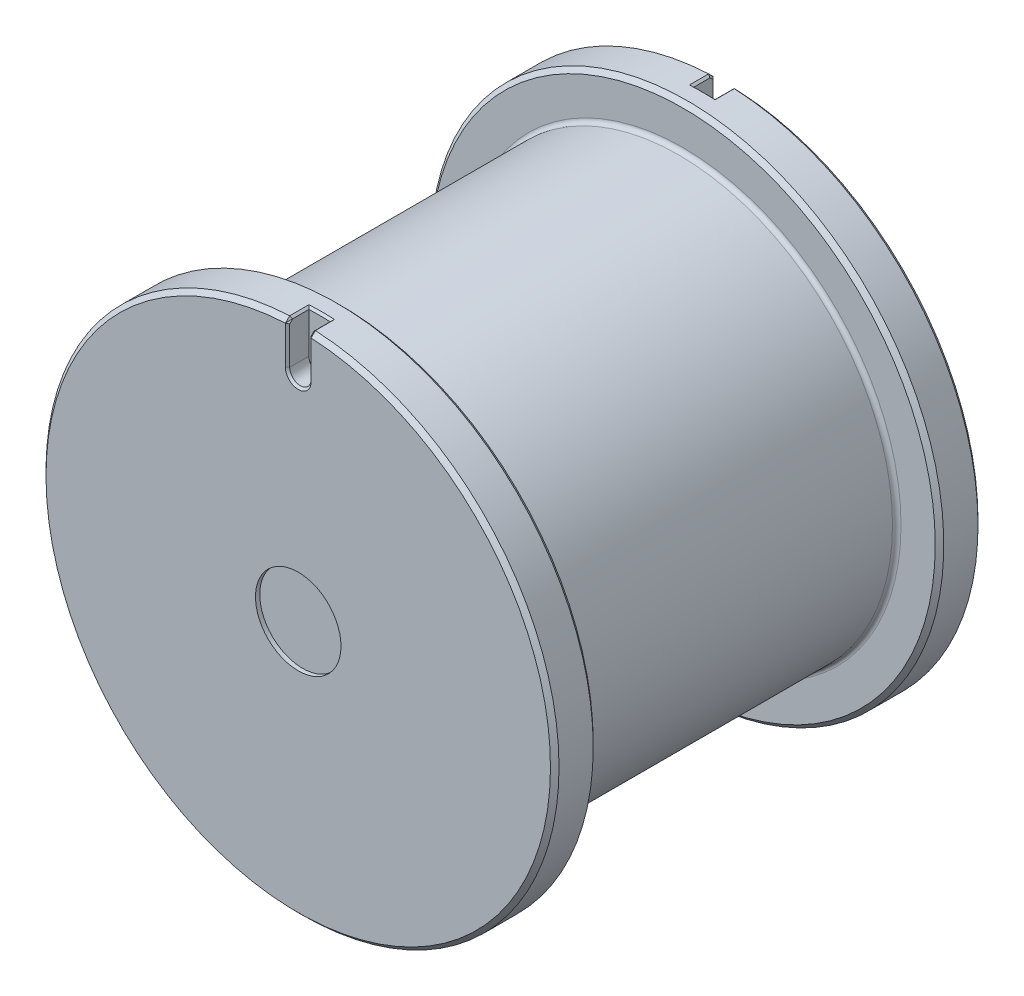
ISO-10303-21;
HEADER;
FILE_DESCRIPTION(('STEP AP214'),'2;1');
FILE_NAME('part.step','',(''),(''),'','','');
FILE_SCHEMA(('AUTOMOTIVE_DESIGN { 1 0 10303 214 1 1 1 1 }'));
ENDSEC;
DATA;
#1=APPLICATION_CONTEXT('core data for automotive mechanical design processes');
#2=APPLICATION_PROTOCOL_DEFINITION('international standard','automotive_design',2000,#1);
#3=PRODUCT_CONTEXT('',#1,'mechanical');
#4=PRODUCT('Part','Part','',(#3));
#5=PRODUCT_RELATED_PRODUCT_CATEGORY('part','',(#4));
#6=PRODUCT_DEFINITION_FORMATION('','',#4);
#7=PRODUCT_DEFINITION_CONTEXT('part definition',#1,'design');
#8=PRODUCT_DEFINITION('design','',#6,#7);
#9=PRODUCT_DEFINITION_SHAPE('','',#8);
#10=(LENGTH_UNIT() NAMED_UNIT(*) SI_UNIT(.MILLI.,.METRE.));
#11=(NAMED_UNIT(*) PLANE_ANGLE_UNIT() SI_UNIT($,.RADIAN.));
#12=(NAMED_UNIT(*) SI_UNIT($,.STERADIAN.) SOLID_ANGLE_UNIT());
#13=UNCERTAINTY_MEASURE_WITH_UNIT(LENGTH_MEASURE(1.E-05),#10,'distance_accuracy_value','');
#14=(GEOMETRIC_REPRESENTATION_CONTEXT(3) GLOBAL_UNCERTAINTY_ASSIGNED_CONTEXT((#13)) GLOBAL_UNIT_ASSIGNED_CONTEXT((#10,
#11,#12)) REPRESENTATION_CONTEXT('',''));
#15=CARTESIAN_POINT('',(0.,0.,0.));
#16=DIRECTION('',(0.,0.,1.));
#17=DIRECTION('',(1.,0.,0.));
#18=AXIS2_PLACEMENT_3D('',#15,#16,#17);
#19=CARTESIAN_POINT('',(0.,0.,-50.));
#20=DIRECTION('',(0.,0.,1.));
#21=DIRECTION('',(1.,0.,0.));
#22=AXIS2_PLACEMENT_3D('',#19,#20,#21);
#23=CYLINDRICAL_SURFACE('',#22,50.);
#24=CARTESIAN_POINT('',(0.,0.,39.));
#25=DIRECTION('',(0.,0.,1.));
#26=DIRECTION('',(1.,0.,0.));
#27=AXIS2_PLACEMENT_3D('',#24,#25,#26);
#28=CIRCLE('',#27,50.);
#29=CARTESIAN_POINT('',(50.,0.,39.));
#30=VERTEX_POINT('',#29);
#31=EDGE_CURVE('E294',#30,#30,#28,.F.);
#32=ORIENTED_EDGE('',*,*,#31,.T.);
#33=EDGE_LOOP('',(#32));
#34=FACE_BOUND('',#33,.T.);
#35=CARTESIAN_POINT('',(0.,0.,-39.));
#36=DIRECTION('',(0.,0.,-1.));
#37=DIRECTION('',(-1.,0.,0.));
#38=AXIS2_PLACEMENT_3D('',#35,#36,#37);
#39=CIRCLE('',#38,50.);
#40=CARTESIAN_POINT('',(-50.,0.,-39.));
#41=VERTEX_POINT('',#40);
#42=EDGE_CURVE('E291',#41,#41,#39,.F.);
#43=ORIENTED_EDGE('',*,*,#42,.T.);
#44=EDGE_LOOP('',(#43));
#45=FACE_BOUND('',#44,.T.);
#46=ADVANCED_FACE('F12',(#34,#45),#23,.T.);
#47=CARTESIAN_POINT('',(0.,0.,40.));
#48=DIRECTION('',(0.,0.,1.));
#49=DIRECTION('',(1.,0.,0.));
#50=AXIS2_PLACEMENT_3D('',#47,#48,#49);
#51=CYLINDRICAL_SURFACE('',#50,60.);
#52=CARTESIAN_POINT('',(0.,0.,49.));
#53=DIRECTION('',(0.,0.,1.));
#54=DIRECTION('',(1.,0.,0.));
#55=AXIS2_PLACEMENT_3D('',#52,#53,#54);
#56=CIRCLE('',#55,60.);
#57=CARTESIAN_POINT('',(3.00122953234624,59.9261482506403,48.9970648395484));
#58=VERTEX_POINT('',#57);
#59=CARTESIAN_POINT('',(-3.00123250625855,59.9261481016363,48.9970648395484));
#60=VERTEX_POINT('',#59);
#61=EDGE_CURVE('E278',#58,#60,#56,.F.);
#62=ORIENTED_EDGE('',*,*,#61,.T.);
#63=DIRECTION('',(0.,0.,1.));
#64=VECTOR('',#63,1.);
#65=CARTESIAN_POINT('',(-2.99741530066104,59.9250824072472,40.));
#66=LINE('',#65,#64);
#67=CARTESIAN_POINT('',(-2.99741530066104,59.9250824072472,44.5));
#68=VERTEX_POINT('',#67);
#69=EDGE_CURVE('E370',#60,#68,#66,.F.);
#70=ORIENTED_EDGE('',*,*,#69,.T.);
#71=CARTESIAN_POINT('',(0.,0.,44.5));
#72=DIRECTION('',(0.,0.,-1.));
#73=DIRECTION('',(-1.,0.,0.));
#74=AXIS2_PLACEMENT_3D('',#71,#72,#73);
#75=CIRCLE('',#74,60.);
#76=CARTESIAN_POINT('',(2.99741530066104,59.9250824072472,44.5));
#77=VERTEX_POINT('',#76);
#78=EDGE_CURVE('E367',#68,#77,#75,.T.);
#79=ORIENTED_EDGE('',*,*,#78,.T.);
#80=DIRECTION('',(0.,0.,1.));
#81=VECTOR('',#80,1.);
#82=CARTESIAN_POINT('',(2.99741530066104,59.9250824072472,40.));
#83=LINE('',#82,#81);
#84=EDGE_CURVE('E373',#77,#58,#83,.T.);
#85=ORIENTED_EDGE('',*,*,#84,.T.);
#86=EDGE_LOOP('',(#62,#70,#79,#85));
#87=FACE_BOUND('',#86,.T.);
#88=CARTESIAN_POINT('',(0.,0.,41.));
#89=DIRECTION('',(0.,0.,1.));
#90=DIRECTION('',(1.,0.,0.));
#91=AXIS2_PLACEMENT_3D('',#88,#89,#90);
#92=CIRCLE('',#91,60.);
#93=CARTESIAN_POINT('',(60.,0.,41.));
#94=VERTEX_POINT('',#93);
#95=EDGE_CURVE('E276',#94,#94,#92,.T.);
#96=ORIENTED_EDGE('',*,*,#95,.T.);
#97=EDGE_LOOP('',(#96));
#98=FACE_BOUND('',#97,.T.);
#99=ADVANCED_FACE('F314',(#87,#98),#51,.T.);
#100=CARTESIAN_POINT('',(0.,0.,40.));
#101=DIRECTION('',(0.,0.,1.));
#102=DIRECTION('',(1.,0.,0.));
#103=AXIS2_PLACEMENT_3D('',#100,#101,#102);
#104=PLANE('',#103);
#105=CARTESIAN_POINT('',(0.,0.,40.));
#106=DIRECTION('',(0.,0.,1.));
#107=DIRECTION('',(1.,0.,0.));
#108=AXIS2_PLACEMENT_3D('',#105,#106,#107);
#109=CIRCLE('',#108,51.);
#110=CARTESIAN_POINT('',(51.,0.,40.));
#111=VERTEX_POINT('',#110);
#112=EDGE_CURVE('E297',#111,#111,#109,.T.);
#113=ORIENTED_EDGE('',*,*,#112,.T.);
#114=EDGE_LOOP('',(#113));
#115=FACE_BOUND('',#114,.T.);
#116=CARTESIAN_POINT('',(0.,0.,40.));
#117=DIRECTION('',(0.,0.,1.));
#118=DIRECTION('',(1.,0.,0.));
#119=AXIS2_PLACEMENT_3D('',#116,#117,#118);
#120=CIRCLE('',#119,59.);
#121=CARTESIAN_POINT('',(59.,0.,40.));
#122=VERTEX_POINT('',#121);
#123=EDGE_CURVE('E288',#122,#122,#120,.F.);
#124=ORIENTED_EDGE('',*,*,#123,.T.);
#125=EDGE_LOOP('',(#124));
#126=FACE_BOUND('',#125,.T.);
#127=ADVANCED_FACE('F320',(#115,#126),#104,.F.);
#128=CARTESIAN_POINT('',(0.,0.,50.));
#129=DIRECTION('',(0.,0.,1.));
#130=DIRECTION('',(1.,0.,0.));
#131=AXIS2_PLACEMENT_3D('',#128,#129,#130);
#132=PLANE('',#131);
#133=CARTESIAN_POINT('',(0.,0.,50.));
#134=DIRECTION('',(0.,0.,1.));
#135=DIRECTION('',(1.,0.,0.));
#136=AXIS2_PLACEMENT_3D('',#133,#134,#135);
#137=CIRCLE('',#136,59.);
#138=CARTESIAN_POINT('',(-3.00273659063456,58.9235400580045,50.));
#139=VERTEX_POINT('',#138);
#140=CARTESIAN_POINT('',(3.0013712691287,58.9236096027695,50.));
#141=VERTEX_POINT('',#140);
#142=EDGE_CURVE('E272',#139,#141,#137,.T.);
#143=ORIENTED_EDGE('',*,*,#142,.T.);
#144=DIRECTION('',(0.,-1.,0.));
#145=VECTOR('',#144,1.);
#146=CARTESIAN_POINT('',(3.,50.,50.));
#147=LINE('',#146,#145);
#148=CARTESIAN_POINT('',(3.,50.,50.));
#149=VERTEX_POINT('',#148);
#150=EDGE_CURVE('E879',#141,#149,#147,.T.);
#151=ORIENTED_EDGE('',*,*,#150,.T.);
#152=CARTESIAN_POINT('',(0.,50.,50.));
#153=DIRECTION('',(0.,0.,1.));
#154=DIRECTION('',(1.,0.,0.));
#155=AXIS2_PLACEMENT_3D('',#152,#153,#154);
#156=CIRCLE('',#155,3.);
#157=CARTESIAN_POINT('',(-3.,50.,50.));
#158=VERTEX_POINT('',#157);
#159=EDGE_CURVE('E883',#149,#158,#156,.F.);
#160=ORIENTED_EDGE('',*,*,#159,.T.);
#161=DIRECTION('',(0.,1.,0.));
#162=VECTOR('',#161,1.);
#163=CARTESIAN_POINT('',(-3.,58.9470101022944,50.));
#164=LINE('',#163,#162);
#165=EDGE_CURVE('E881',#158,#139,#164,.T.);
#166=ORIENTED_EDGE('',*,*,#165,.T.);
#167=EDGE_LOOP('',(#143,#151,#160,#166));
#168=FACE_BOUND('',#167,.T.);
#169=CARTESIAN_POINT('',(0.,0.,50.));
#170=DIRECTION('',(0.,0.,1.));
#171=DIRECTION('',(1.,0.,0.));
#172=AXIS2_PLACEMENT_3D('',#169,#170,#171);
#173=CIRCLE('',#172,10.);
#174=CARTESIAN_POINT('',(10.,0.,50.));
#175=VERTEX_POINT('',#174);
#176=EDGE_CURVE('E468',#175,#175,#173,.T.);
#177=ORIENTED_EDGE('',*,*,#176,.F.);
#178=EDGE_LOOP('',(#177));
#179=FACE_BOUND('',#178,.T.);
#180=ADVANCED_FACE('F710',(#168,#179),#132,.T.);
#181=CARTESIAN_POINT('',(0.,0.,-40.));
#182=DIRECTION('',(0.,0.,-1.));
#183=DIRECTION('',(-1.,0.,0.));
#184=AXIS2_PLACEMENT_3D('',#181,#182,#183);
#185=CYLINDRICAL_SURFACE('',#184,60.);
#186=CARTESIAN_POINT('',(0.,0.,-44.5));
#187=DIRECTION('',(0.,0.,-1.));
#188=DIRECTION('',(-1.,0.,0.));
#189=AXIS2_PLACEMENT_3D('',#186,#187,#188);
#190=CIRCLE('',#189,60.);
#191=CARTESIAN_POINT('',(2.99741530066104,59.9250824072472,-44.5));
#192=VERTEX_POINT('',#191);
#193=CARTESIAN_POINT('',(-2.99741530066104,59.9250824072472,-44.5));
#194=VERTEX_POINT('',#193);
#195=EDGE_CURVE('E550',#192,#194,#190,.F.);
#196=ORIENTED_EDGE('',*,*,#195,.T.);
#197=DIRECTION('',(0.,0.,-1.));
#198=VECTOR('',#197,1.);
#199=CARTESIAN_POINT('',(-2.99741530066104,59.9250824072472,-40.));
#200=LINE('',#199,#198);
#201=CARTESIAN_POINT('',(-3.00122953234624,59.9261482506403,-48.9970648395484));
#202=VERTEX_POINT('',#201);
#203=EDGE_CURVE('E554',#194,#202,#200,.T.);
#204=ORIENTED_EDGE('',*,*,#203,.T.);
#205=CARTESIAN_POINT('',(0.,0.,-49.));
#206=DIRECTION('',(0.,0.,1.));
#207=DIRECTION('',(1.,0.,0.));
#208=AXIS2_PLACEMENT_3D('',#205,#206,#207);
#209=CIRCLE('',#208,60.);
#210=CARTESIAN_POINT('',(2.99993683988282,59.924956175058,-49.));
#211=VERTEX_POINT('',#210);
#212=EDGE_CURVE('E545',#202,#211,#209,.T.);
#213=ORIENTED_EDGE('',*,*,#212,.T.);
#214=DIRECTION('',(0.,0.,-1.));
#215=VECTOR('',#214,1.);
#216=CARTESIAN_POINT('',(2.99741530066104,59.9250824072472,-40.));
#217=LINE('',#216,#215);
#218=EDGE_CURVE('E542',#211,#192,#217,.F.);
#219=ORIENTED_EDGE('',*,*,#218,.T.);
#220=EDGE_LOOP('',(#196,#204,#213,#219));
#221=FACE_BOUND('',#220,.T.);
#222=CARTESIAN_POINT('',(0.,0.,-41.));
#223=DIRECTION('',(0.,0.,-1.));
#224=DIRECTION('',(-1.,0.,0.));
#225=AXIS2_PLACEMENT_3D('',#222,#223,#224);
#226=CIRCLE('',#225,60.);
#227=CARTESIAN_POINT('',(-60.,0.,-41.));
#228=VERTEX_POINT('',#227);
#229=EDGE_CURVE('E479',#228,#228,#226,.T.);
#230=ORIENTED_EDGE('',*,*,#229,.T.);
#231=EDGE_LOOP('',(#230));
#232=FACE_BOUND('',#231,.T.);
#233=ADVANCED_FACE('F707',(#221,#232),#185,.T.);
#234=CARTESIAN_POINT('',(0.,0.,-40.));
#235=DIRECTION('',(0.,0.,-1.));
#236=DIRECTION('',(-1.,0.,0.));
#237=AXIS2_PLACEMENT_3D('',#234,#235,#236);
#238=PLANE('',#237);
#239=CARTESIAN_POINT('',(0.,0.,-40.));
#240=DIRECTION('',(0.,0.,-1.));
#241=DIRECTION('',(-1.,0.,0.));
#242=AXIS2_PLACEMENT_3D('',#239,#240,#241);
#243=CIRCLE('',#242,51.);
#244=CARTESIAN_POINT('',(-51.,0.,-40.));
#245=VERTEX_POINT('',#244);
#246=EDGE_CURVE('E264',#245,#245,#243,.T.);
#247=ORIENTED_EDGE('',*,*,#246,.T.);
#248=EDGE_LOOP('',(#247));
#249=FACE_BOUND('',#248,.T.);
#250=CARTESIAN_POINT('',(0.,0.,-40.));
#251=DIRECTION('',(0.,0.,-1.));
#252=DIRECTION('',(-1.,0.,0.));
#253=AXIS2_PLACEMENT_3D('',#250,#251,#252);
#254=CIRCLE('',#253,59.);
#255=CARTESIAN_POINT('',(-59.,0.,-40.));
#256=VERTEX_POINT('',#255);
#257=EDGE_CURVE('E277',#256,#256,#254,.F.);
#258=ORIENTED_EDGE('',*,*,#257,.T.);
#259=EDGE_LOOP('',(#258));
#260=FACE_BOUND('',#259,.T.);
#261=ADVANCED_FACE('F302',(#249,#260),#238,.F.);
#262=CARTESIAN_POINT('',(0.,0.,-50.));
#263=DIRECTION('',(0.,0.,1.));
#264=DIRECTION('',(1.,0.,0.));
#265=AXIS2_PLACEMENT_3D('',#262,#263,#264);
#266=PLANE('',#265);
#267=CARTESIAN_POINT('',(0.,0.,-50.));
#268=DIRECTION('',(0.,0.,1.));
#269=DIRECTION('',(1.,0.,0.));
#270=AXIS2_PLACEMENT_3D('',#267,#268,#269);
#271=CIRCLE('',#270,59.);
#272=CARTESIAN_POINT('',(3.00273659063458,58.9235400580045,-50.));
#273=VERTEX_POINT('',#272);
#274=CARTESIAN_POINT('',(-3.00198074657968,58.921923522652,-50.000609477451));
#275=VERTEX_POINT('',#274);
#276=EDGE_CURVE('E476',#273,#275,#271,.F.);
#277=ORIENTED_EDGE('',*,*,#276,.T.);
#278=DIRECTION('',(0.,-1.,0.));
#279=VECTOR('',#278,1.);
#280=CARTESIAN_POINT('',(-3.,0.,-50.));
#281=LINE('',#280,#279);
#282=CARTESIAN_POINT('',(-3.,50.,-50.));
#283=VERTEX_POINT('',#282);
#284=EDGE_CURVE('E492',#275,#283,#281,.T.);
#285=ORIENTED_EDGE('',*,*,#284,.T.);
#286=CARTESIAN_POINT('',(0.,50.,-50.));
#287=DIRECTION('',(0.,0.,1.));
#288=DIRECTION('',(1.,0.,0.));
#289=AXIS2_PLACEMENT_3D('',#286,#287,#288);
#290=CIRCLE('',#289,3.);
#291=CARTESIAN_POINT('',(3.,50.,-50.));
#292=VERTEX_POINT('',#291);
#293=EDGE_CURVE('E488',#283,#292,#290,.T.);
#294=ORIENTED_EDGE('',*,*,#293,.T.);
#295=DIRECTION('',(0.,1.,0.));
#296=VECTOR('',#295,1.);
#297=CARTESIAN_POINT('',(3.,0.,-50.));
#298=LINE('',#297,#296);
#299=EDGE_CURVE('E486',#292,#273,#298,.T.);
#300=ORIENTED_EDGE('',*,*,#299,.T.);
#301=EDGE_LOOP('',(#277,#285,#294,#300));
#302=FACE_BOUND('',#301,.T.);
#303=ADVANCED_FACE('F672',(#302),#266,.F.);
#304=CARTESIAN_POINT('',(0.,0.,-50.));
#305=DIRECTION('',(0.,0.,1.));
#306=DIRECTION('',(1.,0.,0.));
#307=AXIS2_PLACEMENT_3D('',#304,#305,#306);
#308=CONICAL_SURFACE('',#307,59.,0.785398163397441);
#309=ORIENTED_EDGE('',*,*,#276,.F.);
#310=CARTESIAN_POINT('',(3.00243511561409,59.9869483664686,-48.9379604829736));
#311=CARTESIAN_POINT('',(3.00253852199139,59.6156037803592,-49.3088356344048));
#312=CARTESIAN_POINT('',(3.0026438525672,59.2442547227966,-49.6797064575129));
#313=CARTESIAN_POINT('',(3.00275121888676,58.8729009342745,-50.0505726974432));
#314=B_SPLINE_CURVE_WITH_KNOTS('',3,(#310,#311,#312,#313),.UNSPECIFIED.,.F.,.F.,(4,4),
(0.0685368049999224,0.0701112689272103),.UNSPECIFIED.);
#315=EDGE_CURVE('E677',#273,#211,#314,.F.);
#316=ORIENTED_EDGE('',*,*,#315,.T.);
#317=ORIENTED_EDGE('',*,*,#212,.F.);
#318=CARTESIAN_POINT('',(-3.00275121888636,58.872900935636,-50.0505726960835));
#319=CARTESIAN_POINT('',(-3.00264385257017,59.2442547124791,-49.679706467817));
#320=CARTESIAN_POINT('',(-3.00253852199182,59.6156037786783,-49.3088356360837));
#321=CARTESIAN_POINT('',(-3.00243511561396,59.986948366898,-48.9379604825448));
#322=B_SPLINE_CURVE_WITH_KNOTS('',3,(#318,#319,#320,#321),.UNSPECIFIED.,.F.,.F.,(4,4),
(0.0685528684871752,0.0701273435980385),.UNSPECIFIED.);
#323=EDGE_CURVE('E675',#202,#275,#322,.F.);
#324=ORIENTED_EDGE('',*,*,#323,.T.);
#325=EDGE_LOOP('',(#309,#316,#317,#324));
#326=FACE_BOUND('',#325,.T.);
#327=ADVANCED_FACE('F688',(#326),#308,.T.);
#328=CARTESIAN_POINT('',(0.,0.,-41.));
#329=DIRECTION('',(0.,0.,-1.));
#330=DIRECTION('',(-1.,0.,0.));
#331=AXIS2_PLACEMENT_3D('',#328,#329,#330);
#332=CONICAL_SURFACE('',#331,60.,0.785398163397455);
#333=ORIENTED_EDGE('',*,*,#257,.F.);
#334=EDGE_LOOP('',(#333));
#335=FACE_BOUND('',#334,.T.);
#336=ORIENTED_EDGE('',*,*,#229,.F.);
#337=EDGE_LOOP('',(#336));
#338=FACE_BOUND('',#337,.T.);
#339=ADVANCED_FACE('F340',(#335,#338),#332,.T.);
#340=CARTESIAN_POINT('',(0.,0.,50.));
#341=DIRECTION('',(0.,0.,-1.));
#342=DIRECTION('',(-1.,0.,0.));
#343=AXIS2_PLACEMENT_3D('',#340,#341,#342);
#344=CONICAL_SURFACE('',#343,59.,0.785398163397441);
#345=ORIENTED_EDGE('',*,*,#142,.F.);
#346=CARTESIAN_POINT('',(-3.00243511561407,59.9869483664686,48.9379604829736));
#347=CARTESIAN_POINT('',(-3.00253852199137,59.6156037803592,49.3088356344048));
#348=CARTESIAN_POINT('',(-3.00264385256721,59.2442547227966,49.6797064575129));
#349=CARTESIAN_POINT('',(-3.00275121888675,58.8729009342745,50.0505726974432));
#350=B_SPLINE_CURVE_WITH_KNOTS('',3,(#346,#347,#348,#349),.UNSPECIFIED.,.F.,.F.,(4,4),
(0.0685368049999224,0.0701112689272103),.UNSPECIFIED.);
#351=EDGE_CURVE('E361',#139,#60,#350,.F.);
#352=ORIENTED_EDGE('',*,*,#351,.T.);
#353=ORIENTED_EDGE('',*,*,#61,.F.);
#354=CARTESIAN_POINT('',(3.00275121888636,58.872900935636,50.0505726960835));
#355=CARTESIAN_POINT('',(3.00264385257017,59.2442547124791,49.679706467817));
#356=CARTESIAN_POINT('',(3.00253852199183,59.6156037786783,49.3088356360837));
#357=CARTESIAN_POINT('',(3.00243511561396,59.986948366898,48.9379604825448));
#358=B_SPLINE_CURVE_WITH_KNOTS('',3,(#354,#355,#356,#357),.UNSPECIFIED.,.F.,.F.,(4,4),
(0.0685528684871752,0.0701273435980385),.UNSPECIFIED.);
#359=EDGE_CURVE('E269',#58,#141,#358,.F.);
#360=ORIENTED_EDGE('',*,*,#359,.T.);
#361=EDGE_LOOP('',(#345,#352,#353,#360));
#362=FACE_BOUND('',#361,.T.);
#363=ADVANCED_FACE('F332',(#362),#344,.T.);
#364=CARTESIAN_POINT('',(0.,0.,41.));
#365=DIRECTION('',(0.,0.,1.));
#366=DIRECTION('',(1.,0.,0.));
#367=AXIS2_PLACEMENT_3D('',#364,#365,#366);
#368=CONICAL_SURFACE('',#367,60.,0.785398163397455);
#369=ORIENTED_EDGE('',*,*,#123,.F.);
#370=EDGE_LOOP('',(#369));
#371=FACE_BOUND('',#370,.T.);
#372=ORIENTED_EDGE('',*,*,#95,.F.);
#373=EDGE_LOOP('',(#372));
#374=FACE_BOUND('',#373,.T.);
#375=ADVANCED_FACE('F326',(#371,#374),#368,.T.);
#376=CARTESIAN_POINT('',(0.,0.,39.));
#377=DIRECTION('',(0.,0.,1.));
#378=DIRECTION('',(1.,0.,0.));
#379=AXIS2_PLACEMENT_3D('',#376,#377,#378);
#380=TOROIDAL_SURFACE('',#379,51.,1.);
#381=ORIENTED_EDGE('',*,*,#112,.F.);
#382=EDGE_LOOP('',(#381));
#383=FACE_BOUND('',#382,.T.);
#384=ORIENTED_EDGE('',*,*,#31,.F.);
#385=EDGE_LOOP('',(#384));
#386=FACE_BOUND('',#385,.T.);
#387=ADVANCED_FACE('F309',(#383,#386),#380,.F.);
#388=CARTESIAN_POINT('',(0.,0.,-39.));
#389=DIRECTION('',(0.,0.,-1.));
#390=DIRECTION('',(-1.,0.,0.));
#391=AXIS2_PLACEMENT_3D('',#388,#389,#390);
#392=TOROIDAL_SURFACE('',#391,51.,1.);
#393=ORIENTED_EDGE('',*,*,#246,.F.);
#394=EDGE_LOOP('',(#393));
#395=FACE_BOUND('',#394,.T.);
#396=ORIENTED_EDGE('',*,*,#42,.F.);
#397=EDGE_LOOP('',(#396));
#398=FACE_BOUND('',#397,.T.);
#399=ADVANCED_FACE('F305',(#395,#398),#392,.F.);
#400=CARTESIAN_POINT('',(0.,0.,49.));
#401=DIRECTION('',(0.,0.,1.));
#402=DIRECTION('',(1.,0.,0.));
#403=AXIS2_PLACEMENT_3D('',#400,#401,#402);
#404=CYLINDRICAL_SURFACE('',#403,10.);
#405=CARTESIAN_POINT('',(0.,0.,49.));
#406=DIRECTION('',(0.,0.,1.));
#407=DIRECTION('',(1.,0.,0.));
#408=AXIS2_PLACEMENT_3D('',#405,#406,#407);
#409=CIRCLE('',#408,10.);
#410=CARTESIAN_POINT('',(10.,0.,49.));
#411=VERTEX_POINT('',#410);
#412=EDGE_CURVE('E473',#411,#411,#409,.T.);
#413=ORIENTED_EDGE('',*,*,#412,.F.);
#414=EDGE_LOOP('',(#413));
#415=FACE_BOUND('',#414,.T.);
#416=ORIENTED_EDGE('',*,*,#176,.T.);
#417=EDGE_LOOP('',(#416));
#418=FACE_BOUND('',#417,.T.);
#419=ADVANCED_FACE('F308',(#415,#418),#404,.F.);
#420=CARTESIAN_POINT('',(0.,0.,49.));
#421=DIRECTION('',(0.,0.,1.));
#422=DIRECTION('',(1.,0.,0.));
#423=AXIS2_PLACEMENT_3D('',#420,#421,#422);
#424=PLANE('',#423);
#425=ORIENTED_EDGE('',*,*,#412,.T.);
#426=EDGE_LOOP('',(#425));
#427=FACE_BOUND('',#426,.T.);
#428=ADVANCED_FACE('F246',(#427),#424,.T.);
#429=CARTESIAN_POINT('',(2.5,50.,45.));
#430=DIRECTION('',(1.,0.,0.));
#431=DIRECTION('',(0.,1.,0.));
#432=AXIS2_PLACEMENT_3D('',#429,#430,#431);
#433=PLANE('',#432);
#434=CARTESIAN_POINT('',(2.5,59.654222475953,48.6048180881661));
#435=CARTESIAN_POINT('',(2.5,59.2828830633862,48.9756932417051));
#436=CARTESIAN_POINT('',(2.5,58.9115393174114,49.3465640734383));
#437=CARTESIAN_POINT('',(2.5,58.5401910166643,49.7174303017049));
#438=B_SPLINE_CURVE_WITH_KNOTS('',3,(#434,#435,#436,#437),.UNSPECIFIED.,.F.,.F.,(4,4),
(0.0685528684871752,0.0701273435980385),.UNSPECIFIED.);
#439=CARTESIAN_POINT('',(2.5,58.7579029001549,49.5));
#440=VERTEX_POINT('',#439);
#441=CARTESIAN_POINT('',(2.5,59.4674935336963,48.7913128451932));
#442=VERTEX_POINT('',#441);
#443=EDGE_CURVE('E389',#440,#442,#438,.F.);
#444=ORIENTED_EDGE('',*,*,#443,.T.);
#445=DIRECTION('',(0.,0.,-1.));
#446=VECTOR('',#445,1.);
#447=CARTESIAN_POINT('',(2.5,59.4674935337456,45.));
#448=LINE('',#447,#446);
#449=CARTESIAN_POINT('',(2.5,59.4674935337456,44.9799799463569));
#450=VERTEX_POINT('',#449);
#451=EDGE_CURVE('E884',#442,#450,#448,.T.);
#452=ORIENTED_EDGE('',*,*,#451,.T.);
#453=CARTESIAN_POINT('',(2.5,59.4674935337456,44.9799799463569));
#454=CARTESIAN_POINT('',(2.5,59.4641539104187,44.9833166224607));
#455=CARTESIAN_POINT('',(2.5,59.4608142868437,44.9866532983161));
#456=CARTESIAN_POINT('',(2.5,59.4541350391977,44.9933266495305));
#457=CARTESIAN_POINT('',(2.5,59.4507954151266,44.9966633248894));
#458=CARTESIAN_POINT('',(2.5,59.4474557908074,45.));
#459=B_SPLINE_CURVE_WITH_KNOTS('',3,(#453,#454,#455,#456,#457,#458),.UNSPECIFIED.,.F.,.F.,(4,2,
4),(0.,0.0141625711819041,0.0283251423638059),.UNSPECIFIED.);
#460=CARTESIAN_POINT('',(2.5,59.4474557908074,45.));
#461=VERTEX_POINT('',#460);
#462=EDGE_CURVE('E230',#450,#461,#459,.T.);
#463=ORIENTED_EDGE('',*,*,#462,.T.);
#464=DIRECTION('',(0.,1.,0.));
#465=VECTOR('',#464,1.);
#466=CARTESIAN_POINT('',(2.5,50.,45.));
#467=LINE('',#466,#465);
#468=CARTESIAN_POINT('',(2.5,50.,45.));
#469=VERTEX_POINT('',#468);
#470=EDGE_CURVE('E461',#469,#461,#467,.T.);
#471=ORIENTED_EDGE('',*,*,#470,.F.);
#472=DIRECTION('',(0.,0.,1.));
#473=VECTOR('',#472,1.);
#474=CARTESIAN_POINT('',(2.5,50.,45.));
#475=LINE('',#474,#473);
#476=CARTESIAN_POINT('',(2.5,50.,49.5));
#477=VERTEX_POINT('',#476);
#478=EDGE_CURVE('E465',#469,#477,#475,.T.);
#479=ORIENTED_EDGE('',*,*,#478,.T.);
#480=DIRECTION('',(0.,1.,0.));
#481=VECTOR('',#480,1.);
#482=CARTESIAN_POINT('',(2.5,58.9470101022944,49.5));
#483=LINE('',#482,#481);
#484=EDGE_CURVE('E379',#477,#440,#483,.T.);
#485=ORIENTED_EDGE('',*,*,#484,.T.);
#486=EDGE_LOOP('',(#444,#452,#463,#471,#479,#485));
#487=FACE_BOUND('',#486,.T.);
#488=ADVANCED_FACE('F395',(#487),#433,.F.);
#489=CARTESIAN_POINT('',(0.,50.,45.));
#490=DIRECTION('',(0.,0.,1.));
#491=DIRECTION('',(1.,0.,0.));
#492=AXIS2_PLACEMENT_3D('',#489,#490,#491);
#493=CYLINDRICAL_SURFACE('',#492,2.5);
#494=DIRECTION('',(0.,0.,1.));
#495=VECTOR('',#494,1.);
#496=CARTESIAN_POINT('',(-2.5,50.,45.));
#497=LINE('',#496,#495);
#498=CARTESIAN_POINT('',(-2.5,50.,45.));
#499=VERTEX_POINT('',#498);
#500=CARTESIAN_POINT('',(-2.5,50.,49.5));
#501=VERTEX_POINT('',#500);
#502=EDGE_CURVE('E464',#499,#501,#497,.T.);
#503=ORIENTED_EDGE('',*,*,#502,.T.);
#504=CARTESIAN_POINT('',(0.,50.,49.5));
#505=DIRECTION('',(0.,0.,1.));
#506=DIRECTION('',(1.,0.,0.));
#507=AXIS2_PLACEMENT_3D('',#504,#505,#506);
#508=CIRCLE('',#507,2.5);
#509=EDGE_CURVE('E872',#501,#477,#508,.T.);
#510=ORIENTED_EDGE('',*,*,#509,.T.);
#511=ORIENTED_EDGE('',*,*,#478,.F.);
#512=CARTESIAN_POINT('',(0.,50.,45.));
#513=DIRECTION('',(0.,0.,1.));
#514=DIRECTION('',(1.,0.,0.));
#515=AXIS2_PLACEMENT_3D('',#512,#513,#514);
#516=CIRCLE('',#515,2.5);
#517=EDGE_CURVE('E457',#499,#469,#516,.T.);
#518=ORIENTED_EDGE('',*,*,#517,.F.);
#519=EDGE_LOOP('',(#503,#510,#511,#518));
#520=FACE_BOUND('',#519,.T.);
#521=ADVANCED_FACE('F244',(#520),#493,.F.);
#522=CARTESIAN_POINT('',(-2.5,64.3998777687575,45.));
#523=DIRECTION('',(-1.,0.,0.));
#524=DIRECTION('',(0.,0.,1.));
#525=AXIS2_PLACEMENT_3D('',#522,#523,#524);
#526=PLANE('',#525);
#527=DIRECTION('',(0.,-1.,0.));
#528=VECTOR('',#527,1.);
#529=CARTESIAN_POINT('',(-2.5,64.3998777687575,45.));
#530=LINE('',#529,#528);
#531=CARTESIAN_POINT('',(-2.5,59.4474557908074,45.));
#532=VERTEX_POINT('',#531);
#533=EDGE_CURVE('E450',#532,#499,#530,.T.);
#534=ORIENTED_EDGE('',*,*,#533,.F.);
#535=CARTESIAN_POINT('',(-2.5,59.4474557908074,45.));
#536=CARTESIAN_POINT('',(-2.5,59.4507954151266,44.9966633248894));
#537=CARTESIAN_POINT('',(-2.5,59.4541350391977,44.9933266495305));
#538=CARTESIAN_POINT('',(-2.5,59.4608142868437,44.9866532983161));
#539=CARTESIAN_POINT('',(-2.5,59.4641539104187,44.9833166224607));
#540=CARTESIAN_POINT('',(-2.5,59.4674935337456,44.9799799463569));
#541=B_SPLINE_CURVE_WITH_KNOTS('',3,(#535,#536,#537,#538,#539,#540),.UNSPECIFIED.,.F.,.F.,(4,2,
4),(0.,0.0141625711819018,0.0283251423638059),.UNSPECIFIED.);
#542=CARTESIAN_POINT('',(-2.5,59.4674935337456,44.9799799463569));
#543=VERTEX_POINT('',#542);
#544=EDGE_CURVE('E223',#532,#543,#541,.T.);
#545=ORIENTED_EDGE('',*,*,#544,.T.);
#546=DIRECTION('',(0.,0.,1.));
#547=VECTOR('',#546,1.);
#548=CARTESIAN_POINT('',(-2.5,59.4674935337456,49.));
#549=LINE('',#548,#547);
#550=CARTESIAN_POINT('',(-2.5,59.4674935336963,48.7913128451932));
#551=VERTEX_POINT('',#550);
#552=EDGE_CURVE('E267',#543,#551,#549,.T.);
#553=ORIENTED_EDGE('',*,*,#552,.T.);
#554=CARTESIAN_POINT('',(-2.5,58.5401910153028,49.7174303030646));
#555=CARTESIAN_POINT('',(-2.5,58.9115393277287,49.3465640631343));
#556=CARTESIAN_POINT('',(-2.5,59.2828830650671,48.9756932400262));
#557=CARTESIAN_POINT('',(-2.5,59.6542224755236,48.6048180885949));
#558=B_SPLINE_CURVE_WITH_KNOTS('',3,(#554,#555,#556,#557),.UNSPECIFIED.,.F.,.F.,(4,4),
(0.0685368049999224,0.0701112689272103),.UNSPECIFIED.);
#559=CARTESIAN_POINT('',(-2.5,58.7579029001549,49.5));
#560=VERTEX_POINT('',#559);
#561=EDGE_CURVE('E263',#551,#560,#558,.F.);
#562=ORIENTED_EDGE('',*,*,#561,.T.);
#563=DIRECTION('',(0.,-1.,0.));
#564=VECTOR('',#563,1.);
#565=CARTESIAN_POINT('',(-2.5,50.,49.5));
#566=LINE('',#565,#564);
#567=EDGE_CURVE('E256',#560,#501,#566,.T.);
#568=ORIENTED_EDGE('',*,*,#567,.T.);
#569=ORIENTED_EDGE('',*,*,#502,.F.);
#570=EDGE_LOOP('',(#534,#545,#553,#562,#568,#569));
#571=FACE_BOUND('',#570,.T.);
#572=ADVANCED_FACE('F238',(#571),#526,.F.);
#573=CARTESIAN_POINT('',(0.,64.3998777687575,45.));
#574=DIRECTION('',(0.,0.,-1.));
#575=DIRECTION('',(-1.,0.,0.));
#576=AXIS2_PLACEMENT_3D('',#573,#574,#575);
#577=PLANE('',#576);
#578=ORIENTED_EDGE('',*,*,#470,.T.);
#579=CARTESIAN_POINT('',(0.,0.,45.));
#580=DIRECTION('',(0.,0.,-1.));
#581=DIRECTION('',(-1.,0.,0.));
#582=AXIS2_PLACEMENT_3D('',#579,#580,#581);
#583=CIRCLE('',#582,59.5);
#584=EDGE_CURVE('E231',#461,#532,#583,.F.);
#585=ORIENTED_EDGE('',*,*,#584,.T.);
#586=ORIENTED_EDGE('',*,*,#533,.T.);
#587=ORIENTED_EDGE('',*,*,#517,.T.);
#588=EDGE_LOOP('',(#578,#585,#586,#587));
#589=FACE_BOUND('',#588,.T.);
#590=ADVANCED_FACE('F243',(#589),#577,.F.);
#591=CARTESIAN_POINT('',(2.5,58.5401910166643,49.7174303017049));
#592=CARTESIAN_POINT('',(2.5,58.9115393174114,49.3465640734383));
#593=CARTESIAN_POINT('',(2.5,59.2828830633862,48.9756932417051));
#594=CARTESIAN_POINT('',(2.5,59.654222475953,48.6048180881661));
#595=CARTESIAN_POINT('',(3.00275121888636,58.872900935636,50.0505726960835));
#596=CARTESIAN_POINT('',(3.00264385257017,59.2442547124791,49.679706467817));
#597=CARTESIAN_POINT('',(3.00253852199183,59.6156037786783,49.3088356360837));
#598=CARTESIAN_POINT('',(3.00243511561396,59.986948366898,48.9379604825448));
#599=B_SPLINE_SURFACE_WITH_KNOTS('',1,3,((#591,#592,#593,#594),(#595,#596,#597,#598)),
.UNSPECIFIED.,.F.,.F.,.F.,(2,2),(4,4),(0.,1.),(0.0685528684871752,0.0701273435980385),.UNSPECIFIED.);
#600=CARTESIAN_POINT('',(2.5,58.7579029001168,49.4999999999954));
#601=CARTESIAN_POINT('',(2.52085558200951,58.7646612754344,49.5208576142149));
#602=CARTESIAN_POINT('',(2.54171129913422,58.7714195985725,49.5417151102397));
#603=CARTESIAN_POINT('',(2.58342323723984,58.7849362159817,49.5834300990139));
#604=CARTESIAN_POINT('',(2.60427945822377,58.7916945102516,49.6042875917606));
#605=CARTESIAN_POINT('',(2.64599240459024,58.80521106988,49.6460025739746));
#606=CARTESIAN_POINT('',(2.6668491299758,58.8119693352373,49.6668600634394));
#607=CARTESIAN_POINT('',(2.70856308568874,58.825485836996,49.7085750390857));
#608=CARTESIAN_POINT('',(2.72942031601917,58.8322440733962,49.7294325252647));
#609=CARTESIAN_POINT('',(2.77113528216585,58.845760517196,49.7711474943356));
#610=CARTESIAN_POINT('',(2.79199301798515,58.8525187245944,49.7920049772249));
#611=CARTESIAN_POINT('',(2.83370899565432,58.8660351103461,49.8337199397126));
#612=CARTESIAN_POINT('',(2.85456723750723,58.8727932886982,49.8545774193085));
#613=CARTESIAN_POINT('',(2.89628422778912,58.8863096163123,49.8962923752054));
#614=CARTESIAN_POINT('',(2.91714297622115,58.8930677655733,49.9171498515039));
#615=CARTESIAN_POINT('',(2.95886098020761,58.9065840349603,49.9588648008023));
#616=CARTESIAN_POINT('',(2.9797202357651,58.9133421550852,49.9797222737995));
#617=CARTESIAN_POINT('',(3.00057962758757,58.9201002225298,50.0005796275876));
#618=B_SPLINE_CURVE_WITH_KNOTS('',3,(#600,#601,#602,#603,#604,#605,#606,#607,#608,#609,#610,
#611,#612,#613,#614,#615,#616,#617),.UNSPECIFIED.,.F.,.F.,(4,2,2,2,2,2,2,2,4),(0.,
0.0907801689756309,0.181561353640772,0.272343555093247,0.363126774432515,0.45391101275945,
0.544696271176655,0.635482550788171,0.72626985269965),.UNSPECIFIED.);
#619=EDGE_CURVE('E897',#141,#440,#618,.F.);
#620=CARTESIAN_POINT('',(3.00000663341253,59.9274662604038,48.9941296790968));
#621=CARTESIAN_POINT('',(2.97917442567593,59.9083005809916,48.985678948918));
#622=CARTESIAN_POINT('',(2.9583421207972,59.889134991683,48.9772282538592));
#623=CARTESIAN_POINT('',(2.91667713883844,59.8508038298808,48.9603268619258));
#624=CARTESIAN_POINT('',(2.89584446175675,59.8316382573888,48.9518761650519));
#625=CARTESIAN_POINT('',(2.85417873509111,59.793307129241,48.9349747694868));
#626=CARTESIAN_POINT('',(2.83334568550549,59.7741415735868,48.9265240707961));
#627=CARTESIAN_POINT('',(2.79167921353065,59.7358104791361,48.9096226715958));
#628=CARTESIAN_POINT('',(2.77084579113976,59.7166449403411,48.9011719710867));
#629=CARTESIAN_POINT('',(2.7291785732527,59.67831387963,48.8842705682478));
#630=CARTESIAN_POINT('',(2.70834477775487,59.6591483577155,48.8758198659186));
#631=CARTESIAN_POINT('',(2.66667681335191,59.620817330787,48.8589184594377));
#632=CARTESIAN_POINT('',(2.64584264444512,59.6016518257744,48.8504677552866));
#633=CARTESIAN_POINT('',(2.60417393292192,59.5633208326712,48.8335663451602));
#634=CARTESIAN_POINT('',(2.58333939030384,59.544155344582,48.8251156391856));
#635=CARTESIAN_POINT('',(2.54166993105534,59.505824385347,48.8082142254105));
#636=CARTESIAN_POINT('',(2.52083501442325,59.4866589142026,48.7997635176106));
#637=CARTESIAN_POINT('',(2.50000000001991,59.4674935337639,48.791312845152));
#638=B_SPLINE_CURVE_WITH_KNOTS('',3,(#620,#621,#622,#623,#624,#625,#626,#627,#628,#629,#630,
#631,#632,#633,#634,#635,#636,#637),.UNSPECIFIED.,.F.,.F.,(4,2,2,2,2,2,2,2,4),(0.,
0.0886254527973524,0.177251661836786,0.265878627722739,0.354506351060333,0.443134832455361,
0.531764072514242,0.620394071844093,0.709024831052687),.UNSPECIFIED.);
#639=EDGE_CURVE('E458',#442,#58,#638,.F.);
#640=ORIENTED_EDGE('',*,*,#619,.F.);
#641=ORIENTED_EDGE('',*,*,#359,.F.);
#642=ORIENTED_EDGE('',*,*,#639,.F.);
#643=ORIENTED_EDGE('',*,*,#443,.F.);
#644=EDGE_LOOP('',(#640,#641,#642,#643));
#645=FACE_BOUND('',#644,.T.);
#646=ADVANCED_FACE('F407',(#645),#599,.T.);
#647=CARTESIAN_POINT('',(2.5,59.4674935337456,40.));
#648=DIRECTION('',(-0.677029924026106,0.735955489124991,0.));
#649=DIRECTION('',(-0.735955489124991,-0.677029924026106,0.));
#650=AXIS2_PLACEMENT_3D('',#647,#648,#649);
#651=PLANE('',#650);
#652=ORIENTED_EDGE('',*,*,#639,.T.);
#653=ORIENTED_EDGE('',*,*,#84,.F.);
#654=CARTESIAN_POINT('',(2.5,59.4674935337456,44.9799799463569));
#655=CARTESIAN_POINT('',(2.58301225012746,59.5438592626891,44.9001931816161));
#656=CARTESIAN_POINT('',(2.66596965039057,59.6201745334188,44.8203014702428));
#657=CARTESIAN_POINT('',(2.83177475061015,59.7727041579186,44.6603081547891));
#658=CARTESIAN_POINT('',(2.91462245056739,59.8489185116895,44.58020655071));
#659=CARTESIAN_POINT('',(2.99741530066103,59.9250824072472,44.5));
#660=B_SPLINE_CURVE_WITH_KNOTS('',3,(#654,#655,#656,#657,#658,#659),.UNSPECIFIED.,.F.,.F.,(4,2,
4),(0.,0.414484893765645,0.82896978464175),.UNSPECIFIED.);
#661=EDGE_CURVE('E217',#450,#77,#660,.T.);
#662=ORIENTED_EDGE('',*,*,#661,.F.);
#663=ORIENTED_EDGE('',*,*,#451,.F.);
#664=EDGE_LOOP('',(#652,#653,#662,#663));
#665=FACE_BOUND('',#664,.T.);
#666=ADVANCED_FACE('F414',(#665),#651,.T.);
#667=CARTESIAN_POINT('',(2.5,50.,49.5));
#668=DIRECTION('',(-0.707106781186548,0.,0.707106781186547));
#669=DIRECTION('',(0.707106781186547,0.,0.707106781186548));
#670=AXIS2_PLACEMENT_3D('',#667,#668,#669);
#671=PLANE('',#670);
#672=ORIENTED_EDGE('',*,*,#619,.T.);
#673=ORIENTED_EDGE('',*,*,#484,.F.);
#674=DIRECTION('',(-0.707106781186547,0.,-0.707106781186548));
#675=VECTOR('',#674,1.);
#676=CARTESIAN_POINT('',(3.,50.,50.));
#677=LINE('',#676,#675);
#678=EDGE_CURVE('E200',#149,#477,#677,.T.);
#679=ORIENTED_EDGE('',*,*,#678,.F.);
#680=ORIENTED_EDGE('',*,*,#150,.F.);
#681=EDGE_LOOP('',(#672,#673,#679,#680));
#682=FACE_BOUND('',#681,.T.);
#683=ADVANCED_FACE('F210',(#682),#671,.T.);
#684=CARTESIAN_POINT('',(0.,0.,45.));
#685=DIRECTION('',(0.,0.,-1.));
#686=DIRECTION('',(-1.,0.,0.));
#687=AXIS2_PLACEMENT_3D('',#684,#685,#686);
#688=CONICAL_SURFACE('',#687,59.5,0.785398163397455);
#689=ORIENTED_EDGE('',*,*,#661,.T.);
#690=ORIENTED_EDGE('',*,*,#78,.F.);
#691=CARTESIAN_POINT('',(-2.99741530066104,59.9250824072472,44.5));
#692=CARTESIAN_POINT('',(-2.91462245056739,59.8489185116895,44.58020655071));
#693=CARTESIAN_POINT('',(-2.83177475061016,59.7727041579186,44.6603081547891));
#694=CARTESIAN_POINT('',(-2.66596965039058,59.6201745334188,44.8203014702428));
#695=CARTESIAN_POINT('',(-2.58301225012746,59.5438592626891,44.9001931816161));
#696=CARTESIAN_POINT('',(-2.5,59.4674935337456,44.9799799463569));
#697=B_SPLINE_CURVE_WITH_KNOTS('',3,(#691,#692,#693,#694,#695,#696),.UNSPECIFIED.,.F.,.F.,(4,2,
4),(0.,0.414484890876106,0.828969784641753),.UNSPECIFIED.);
#698=EDGE_CURVE('E191',#543,#68,#697,.F.);
#699=ORIENTED_EDGE('',*,*,#698,.F.);
#700=ORIENTED_EDGE('',*,*,#544,.F.);
#701=ORIENTED_EDGE('',*,*,#584,.F.);
#702=ORIENTED_EDGE('',*,*,#462,.F.);
#703=EDGE_LOOP('',(#689,#690,#699,#700,#701,#702));
#704=FACE_BOUND('',#703,.T.);
#705=ADVANCED_FACE('F205',(#704),#688,.T.);
#706=CARTESIAN_POINT('',(0.,50.,49.5));
#707=DIRECTION('',(0.,0.,1.));
#708=DIRECTION('',(1.,0.,0.));
#709=AXIS2_PLACEMENT_3D('',#706,#707,#708);
#710=CONICAL_SURFACE('',#709,2.5,0.785398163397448);
#711=ORIENTED_EDGE('',*,*,#678,.T.);
#712=ORIENTED_EDGE('',*,*,#509,.F.);
#713=DIRECTION('',(0.707106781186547,0.,-0.707106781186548));
#714=VECTOR('',#713,1.);
#715=CARTESIAN_POINT('',(-3.,50.,50.));
#716=LINE('',#715,#714);
#717=EDGE_CURVE('E188',#158,#501,#716,.T.);
#718=ORIENTED_EDGE('',*,*,#717,.F.);
#719=ORIENTED_EDGE('',*,*,#159,.F.);
#720=EDGE_LOOP('',(#711,#712,#718,#719));
#721=FACE_BOUND('',#720,.T.);
#722=ADVANCED_FACE('F209',(#721),#710,.F.);
#723=CARTESIAN_POINT('',(-2.5,59.4674935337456,40.));
#724=DIRECTION('',(-0.677029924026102,-0.735955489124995,0.));
#725=DIRECTION('',(0.735955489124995,-0.677029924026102,0.));
#726=AXIS2_PLACEMENT_3D('',#723,#724,#725);
#727=PLANE('',#726);
#728=ORIENTED_EDGE('',*,*,#698,.T.);
#729=ORIENTED_EDGE('',*,*,#69,.F.);
#730=CARTESIAN_POINT('',(-2.5,59.4674935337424,48.7913128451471));
#731=CARTESIAN_POINT('',(-2.52083501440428,59.486658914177,48.7997635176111));
#732=CARTESIAN_POINT('',(-2.54166993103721,59.5058243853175,48.8082142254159));
#733=CARTESIAN_POINT('',(-2.58333939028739,59.544155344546,48.8251156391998));
#734=CARTESIAN_POINT('',(-2.60417393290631,59.5633208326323,48.8335663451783));
#735=CARTESIAN_POINT('',(-2.64584264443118,59.6016518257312,48.8504677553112));
#736=CARTESIAN_POINT('',(-2.66667681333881,59.6208173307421,48.858918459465));
#737=CARTESIAN_POINT('',(-2.70834477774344,59.6591483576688,48.87581986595));
#738=CARTESIAN_POINT('',(-2.72917857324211,59.678313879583,48.8842705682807));
#739=CARTESIAN_POINT('',(-2.77084579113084,59.716644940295,48.9011719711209));
#740=CARTESIAN_POINT('',(-2.79167921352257,59.7358104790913,48.9096226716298));
#741=CARTESIAN_POINT('',(-2.83334568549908,59.7741415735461,48.9265240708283));
#742=CARTESIAN_POINT('',(-2.85417873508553,59.7933071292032,48.9349747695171));
#743=CARTESIAN_POINT('',(-2.89584446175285,59.8316382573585,48.9518761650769));
#744=CARTESIAN_POINT('',(-2.91667713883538,59.8508038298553,48.9603268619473));
#745=CARTESIAN_POINT('',(-2.95834212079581,59.8891349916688,48.9772282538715));
#746=CARTESIAN_POINT('',(-2.97917442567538,59.9083005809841,48.9856789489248));
#747=CARTESIAN_POINT('',(-3.00000663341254,59.9274662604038,48.9941296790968));
#748=B_SPLINE_CURVE_WITH_KNOTS('',3,(#730,#731,#732,#733,#734,#735,#736,#737,#738,#739,#740,
#741,#742,#743,#744,#745,#746,#747),.UNSPECIFIED.,.F.,.F.,(4,2,2,2,2,2,2,2,4),(0.,
0.0886307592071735,0.177260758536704,0.265889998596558,0.354518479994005,0.443146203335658,
0.531773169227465,0.620399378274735,0.709024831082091),.UNSPECIFIED.);
#749=EDGE_CURVE('E192',#551,#60,#748,.T.);
#750=ORIENTED_EDGE('',*,*,#749,.F.);
#751=ORIENTED_EDGE('',*,*,#552,.F.);
#752=EDGE_LOOP('',(#728,#729,#750,#751));
#753=FACE_BOUND('',#752,.T.);
#754=ADVANCED_FACE('F202',(#753),#727,.F.);
#755=CARTESIAN_POINT('',(-2.5,64.3998777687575,49.5));
#756=DIRECTION('',(0.707106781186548,0.,0.707106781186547));
#757=DIRECTION('',(0.707106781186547,0.,-0.707106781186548));
#758=AXIS2_PLACEMENT_3D('',#755,#756,#757);
#759=PLANE('',#758);
#760=ORIENTED_EDGE('',*,*,#717,.T.);
#761=ORIENTED_EDGE('',*,*,#567,.F.);
#762=CARTESIAN_POINT('',(-3.00121895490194,58.9203072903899,50.0012189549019));
#763=CARTESIAN_POINT('',(-2.98033291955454,58.9135405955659,49.9803349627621));
#764=CARTESIAN_POINT('',(-2.95944702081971,58.9067738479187,49.9594508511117));
#765=CARTESIAN_POINT('',(-2.91767573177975,58.8932403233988,49.9176826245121));
#766=CARTESIAN_POINT('',(-2.89679034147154,58.8864735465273,49.8967985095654));
#767=CARTESIAN_POINT('',(-2.85502006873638,58.8729399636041,49.8550302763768));
#768=CARTESIAN_POINT('',(-2.83413518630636,58.8661731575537,49.8341461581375));
#769=CARTESIAN_POINT('',(-2.79236592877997,58.8526395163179,49.7923779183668));
#770=CARTESIAN_POINT('',(-2.77148155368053,58.8458726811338,49.7714937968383));
#771=CARTESIAN_POINT('',(-2.72971331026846,58.832338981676,49.7297255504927));
#772=CARTESIAN_POINT('',(-2.70882944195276,58.8255721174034,49.7088414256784));
#773=CARTESIAN_POINT('',(-2.66706221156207,58.8120383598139,49.6670731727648));
#774=CARTESIAN_POINT('',(-2.64617884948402,58.8052714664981,49.6461890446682));
#775=CARTESIAN_POINT('',(-2.60441263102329,58.791737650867,49.6044207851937));
#776=CARTESIAN_POINT('',(-2.58352977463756,58.7849707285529,49.5835366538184));
#777=CARTESIAN_POINT('',(-2.54176456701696,58.7714368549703,49.5417683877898));
#778=CARTESIAN_POINT('',(-2.52088221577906,58.7646699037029,49.5208842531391));
#779=CARTESIAN_POINT('',(-2.5,58.7579029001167,49.4999999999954));
#780=B_SPLINE_CURVE_WITH_KNOTS('',3,(#762,#763,#764,#765,#766,#767,#768,#769,#770,#771,#772,
#773,#774,#775,#776,#777,#778,#779),.UNSPECIFIED.,.F.,.F.,(4,2,2,2,2,2,2,2,4),(0.,
0.0909032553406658,0.181805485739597,0.272706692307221,0.363606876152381,0.45450603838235,
0.545404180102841,0.636301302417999,0.727197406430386),.UNSPECIFIED.);
#781=EDGE_CURVE('E186',#139,#560,#780,.T.);
#782=ORIENTED_EDGE('',*,*,#781,.F.);
#783=ORIENTED_EDGE('',*,*,#165,.F.);
#784=EDGE_LOOP('',(#760,#761,#782,#783));
#785=FACE_BOUND('',#784,.T.);
#786=ADVANCED_FACE('F743',(#785),#759,.T.);
#787=CARTESIAN_POINT('',(-2.5,59.6542224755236,48.6048180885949));
#788=CARTESIAN_POINT('',(-2.5,59.2828830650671,48.9756932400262));
#789=CARTESIAN_POINT('',(-2.5,58.9115393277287,49.3465640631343));
#790=CARTESIAN_POINT('',(-2.5,58.5401910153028,49.7174303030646));
#791=CARTESIAN_POINT('',(-3.00243511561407,59.9869483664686,48.9379604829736));
#792=CARTESIAN_POINT('',(-3.00253852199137,59.6156037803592,49.3088356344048));
#793=CARTESIAN_POINT('',(-3.00264385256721,59.2442547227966,49.6797064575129));
#794=CARTESIAN_POINT('',(-3.00275121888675,58.8729009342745,50.0505726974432));
#795=B_SPLINE_SURFACE_WITH_KNOTS('',1,3,((#787,#788,#789,#790),(#791,#792,#793,#794)),
.UNSPECIFIED.,.F.,.F.,.F.,(2,2),(4,4),(0.,1.),(0.0685368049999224,0.0701112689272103),.UNSPECIFIED.);
#796=ORIENTED_EDGE('',*,*,#749,.T.);
#797=ORIENTED_EDGE('',*,*,#351,.F.);
#798=ORIENTED_EDGE('',*,*,#781,.T.);
#799=ORIENTED_EDGE('',*,*,#561,.F.);
#800=EDGE_LOOP('',(#796,#797,#798,#799));
#801=FACE_BOUND('',#800,.T.);
#802=ADVANCED_FACE('F749',(#801),#795,.T.);
#803=CARTESIAN_POINT('',(0.,50.,-45.));
#804=DIRECTION('',(0.,0.,-1.));
#805=DIRECTION('',(-1.,0.,0.));
#806=AXIS2_PLACEMENT_3D('',#803,#804,#805);
#807=CYLINDRICAL_SURFACE('',#806,2.5);
#808=DIRECTION('',(0.,0.,-1.));
#809=VECTOR('',#808,1.);
#810=CARTESIAN_POINT('',(2.5,50.,-45.));
#811=LINE('',#810,#809);
#812=CARTESIAN_POINT('',(2.5,50.,-45.));
#813=VERTEX_POINT('',#812);
#814=CARTESIAN_POINT('',(2.5,50.,-49.5));
#815=VERTEX_POINT('',#814);
#816=EDGE_CURVE('E162',#813,#815,#811,.T.);
#817=ORIENTED_EDGE('',*,*,#816,.T.);
#818=CARTESIAN_POINT('',(0.,50.,-49.5));
#819=DIRECTION('',(0.,0.,1.));
#820=DIRECTION('',(1.,0.,0.));
#821=AXIS2_PLACEMENT_3D('',#818,#819,#820);
#822=CIRCLE('',#821,2.5);
#823=CARTESIAN_POINT('',(-2.5,50.,-49.5));
#824=VERTEX_POINT('',#823);
#825=EDGE_CURVE('E160',#815,#824,#822,.F.);
#826=ORIENTED_EDGE('',*,*,#825,.T.);
#827=DIRECTION('',(0.,0.,-1.));
#828=VECTOR('',#827,1.);
#829=CARTESIAN_POINT('',(-2.5,50.,-45.));
#830=LINE('',#829,#828);
#831=CARTESIAN_POINT('',(-2.5,50.,-45.));
#832=VERTEX_POINT('',#831);
#833=EDGE_CURVE('E153',#832,#824,#830,.T.);
#834=ORIENTED_EDGE('',*,*,#833,.F.);
#835=CARTESIAN_POINT('',(0.,50.,-45.));
#836=DIRECTION('',(0.,0.,-1.));
#837=DIRECTION('',(-1.,0.,0.));
#838=AXIS2_PLACEMENT_3D('',#835,#836,#837);
#839=CIRCLE('',#838,2.5);
#840=EDGE_CURVE('E158',#813,#832,#839,.T.);
#841=ORIENTED_EDGE('',*,*,#840,.F.);
#842=EDGE_LOOP('',(#817,#826,#834,#841));
#843=FACE_BOUND('',#842,.T.);
#844=ADVANCED_FACE('F156',(#843),#807,.F.);
#845=CARTESIAN_POINT('',(2.5,50.,-45.));
#846=DIRECTION('',(1.,0.,0.));
#847=DIRECTION('',(0.,0.,-1.));
#848=AXIS2_PLACEMENT_3D('',#845,#846,#847);
#849=PLANE('',#848);
#850=CARTESIAN_POINT('',(2.5,58.5401910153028,-49.7174303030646));
#851=CARTESIAN_POINT('',(2.5,58.9115393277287,-49.3465640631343));
#852=CARTESIAN_POINT('',(2.5,59.2828830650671,-48.9756932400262));
#853=CARTESIAN_POINT('',(2.5,59.6542224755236,-48.6048180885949));
#854=B_SPLINE_CURVE_WITH_KNOTS('',3,(#850,#851,#852,#853),.UNSPECIFIED.,.F.,.F.,(4,4),
(0.0685368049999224,0.0701112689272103),.UNSPECIFIED.);
#855=CARTESIAN_POINT('',(2.5,59.4674935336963,-48.7913128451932));
#856=VERTEX_POINT('',#855);
#857=CARTESIAN_POINT('',(2.5,58.7579029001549,-49.4999999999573));
#858=VERTEX_POINT('',#857);
#859=EDGE_CURVE('E497',#856,#858,#854,.F.);
#860=ORIENTED_EDGE('',*,*,#859,.T.);
#861=DIRECTION('',(0.,-1.,0.));
#862=VECTOR('',#861,1.);
#863=CARTESIAN_POINT('',(2.5,50.,-49.5));
#864=LINE('',#863,#862);
#865=EDGE_CURVE('E674',#858,#815,#864,.T.);
#866=ORIENTED_EDGE('',*,*,#865,.T.);
#867=ORIENTED_EDGE('',*,*,#816,.F.);
#868=DIRECTION('',(0.,-1.,0.));
#869=VECTOR('',#868,1.);
#870=CARTESIAN_POINT('',(2.5,50.,-45.));
#871=LINE('',#870,#869);
#872=CARTESIAN_POINT('',(2.5,59.4474557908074,-45.));
#873=VERTEX_POINT('',#872);
#874=EDGE_CURVE('E163',#873,#813,#871,.T.);
#875=ORIENTED_EDGE('',*,*,#874,.F.);
#876=CARTESIAN_POINT('',(2.5,59.4474557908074,-45.));
#877=CARTESIAN_POINT('',(2.5,59.4507954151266,-44.9966633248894));
#878=CARTESIAN_POINT('',(2.5,59.4541350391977,-44.9933266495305));
#879=CARTESIAN_POINT('',(2.5,59.4608142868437,-44.9866532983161));
#880=CARTESIAN_POINT('',(2.5,59.4641539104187,-44.9833166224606));
#881=CARTESIAN_POINT('',(2.5,59.4674935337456,-44.9799799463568));
#882=B_SPLINE_CURVE_WITH_KNOTS('',3,(#876,#877,#878,#879,#880,#881),.UNSPECIFIED.,.F.,.F.,(4,2,
4),(0.,0.0141625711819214,0.0283251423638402),.UNSPECIFIED.);
#883=CARTESIAN_POINT('',(2.5,59.4674935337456,-44.9799799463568));
#884=VERTEX_POINT('',#883);
#885=EDGE_CURVE('E9',#873,#884,#882,.T.);
#886=ORIENTED_EDGE('',*,*,#885,.T.);
#887=DIRECTION('',(0.,0.,-1.));
#888=VECTOR('',#887,1.);
#889=CARTESIAN_POINT('',(2.5,59.4674935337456,-49.));
#890=LINE('',#889,#888);
#891=EDGE_CURVE('E31',#884,#856,#890,.T.);
#892=ORIENTED_EDGE('',*,*,#891,.T.);
#893=EDGE_LOOP('',(#860,#866,#867,#875,#886,#892));
#894=FACE_BOUND('',#893,.T.);
#895=ADVANCED_FACE('F506',(#894),#849,.F.);
#896=CARTESIAN_POINT('',(-2.5,61.5002571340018,-45.));
#897=DIRECTION('',(-1.,0.,0.));
#898=DIRECTION('',(0.,-1.,0.));
#899=AXIS2_PLACEMENT_3D('',#896,#897,#898);
#900=PLANE('',#899);
#901=CARTESIAN_POINT('',(-2.5,59.654222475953,-48.6048180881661));
#902=CARTESIAN_POINT('',(-2.5,59.2828830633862,-48.9756932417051));
#903=CARTESIAN_POINT('',(-2.5,58.9115393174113,-49.3465640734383));
#904=CARTESIAN_POINT('',(-2.5,58.5401910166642,-49.7174303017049));
#905=B_SPLINE_CURVE_WITH_KNOTS('',3,(#901,#902,#903,#904),.UNSPECIFIED.,.F.,.F.,(4,4),
(0.0685528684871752,0.0701273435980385),.UNSPECIFIED.);
#906=CARTESIAN_POINT('',(-2.5,58.7579029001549,-49.4999999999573));
#907=VERTEX_POINT('',#906);
#908=CARTESIAN_POINT('',(-2.5,59.4674935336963,-48.7913128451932));
#909=VERTEX_POINT('',#908);
#910=EDGE_CURVE('E538',#907,#909,#905,.F.);
#911=ORIENTED_EDGE('',*,*,#910,.T.);
#912=DIRECTION('',(0.,0.,1.));
#913=VECTOR('',#912,1.);
#914=CARTESIAN_POINT('',(-2.5,59.4674935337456,-45.));
#915=LINE('',#914,#913);
#916=CARTESIAN_POINT('',(-2.5,59.4674935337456,-44.9799799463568));
#917=VERTEX_POINT('',#916);
#918=EDGE_CURVE('E38',#909,#917,#915,.T.);
#919=ORIENTED_EDGE('',*,*,#918,.T.);
#920=CARTESIAN_POINT('',(-2.5,59.4674935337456,-44.9799799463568));
#921=CARTESIAN_POINT('',(-2.5,59.4641539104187,-44.9833166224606));
#922=CARTESIAN_POINT('',(-2.5,59.4608142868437,-44.9866532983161));
#923=CARTESIAN_POINT('',(-2.5,59.4541350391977,-44.9933266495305));
#924=CARTESIAN_POINT('',(-2.5,59.4507954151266,-44.9966633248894));
#925=CARTESIAN_POINT('',(-2.5,59.4474557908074,-45.));
#926=B_SPLINE_CURVE_WITH_KNOTS('',3,(#920,#921,#922,#923,#924,#925),.UNSPECIFIED.,.F.,.F.,(4,2,
4),(0.,0.0141625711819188,0.0283251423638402),.UNSPECIFIED.);
#927=CARTESIAN_POINT('',(-2.5,59.4474557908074,-45.));
#928=VERTEX_POINT('',#927);
#929=EDGE_CURVE('E24',#917,#928,#926,.T.);
#930=ORIENTED_EDGE('',*,*,#929,.T.);
#931=DIRECTION('',(0.,1.,0.));
#932=VECTOR('',#931,1.);
#933=CARTESIAN_POINT('',(-2.5,61.5002571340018,-45.));
#934=LINE('',#933,#932);
#935=EDGE_CURVE('E166',#832,#928,#934,.T.);
#936=ORIENTED_EDGE('',*,*,#935,.F.);
#937=ORIENTED_EDGE('',*,*,#833,.T.);
#938=DIRECTION('',(0.,1.,0.));
#939=VECTOR('',#938,1.);
#940=CARTESIAN_POINT('',(-2.5,61.5002571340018,-49.5));
#941=LINE('',#940,#939);
#942=EDGE_CURVE('E531',#824,#907,#941,.T.);
#943=ORIENTED_EDGE('',*,*,#942,.T.);
#944=EDGE_LOOP('',(#911,#919,#930,#936,#937,#943));
#945=FACE_BOUND('',#944,.T.);
#946=ADVANCED_FACE('F167',(#945),#900,.F.);
#947=CARTESIAN_POINT('',(0.,50.,-45.));
#948=DIRECTION('',(0.,0.,-1.));
#949=DIRECTION('',(-1.,0.,0.));
#950=AXIS2_PLACEMENT_3D('',#947,#948,#949);
#951=PLANE('',#950);
#952=ORIENTED_EDGE('',*,*,#935,.T.);
#953=CARTESIAN_POINT('',(0.,0.,-45.));
#954=DIRECTION('',(0.,0.,-1.));
#955=DIRECTION('',(-1.,0.,0.));
#956=AXIS2_PLACEMENT_3D('',#953,#954,#955);
#957=CIRCLE('',#956,59.5);
#958=EDGE_CURVE('E484',#928,#873,#957,.T.);
#959=ORIENTED_EDGE('',*,*,#958,.T.);
#960=ORIENTED_EDGE('',*,*,#874,.T.);
#961=ORIENTED_EDGE('',*,*,#840,.T.);
#962=EDGE_LOOP('',(#952,#959,#960,#961));
#963=FACE_BOUND('',#962,.T.);
#964=ADVANCED_FACE('F171',(#963),#951,.T.);
#965=CARTESIAN_POINT('',(2.5,50.,-49.5));
#966=DIRECTION('',(0.707106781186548,0.,0.707106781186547));
#967=DIRECTION('',(0.707106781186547,0.,-0.707106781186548));
#968=AXIS2_PLACEMENT_3D('',#965,#966,#967);
#969=PLANE('',#968);
#970=CARTESIAN_POINT('',(3.00121895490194,58.9203072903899,-50.0012189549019));
#971=CARTESIAN_POINT('',(2.98033291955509,58.9135405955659,-49.9803349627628));
#972=CARTESIAN_POINT('',(2.95944702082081,58.9067738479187,-49.9594508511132));
#973=CARTESIAN_POINT('',(2.91767573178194,58.8932403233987,-49.917682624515));
#974=CARTESIAN_POINT('',(2.89679034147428,58.8864735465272,-49.8967985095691));
#975=CARTESIAN_POINT('',(2.85502006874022,58.872939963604,-49.855030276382));
#976=CARTESIAN_POINT('',(2.83413518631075,58.8661731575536,-49.8341461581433));
#977=CARTESIAN_POINT('',(2.79236592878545,58.8526395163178,-49.7923779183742));
#978=CARTESIAN_POINT('',(2.77148155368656,58.8458726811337,-49.7714937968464));
#979=CARTESIAN_POINT('',(2.72971331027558,58.8323389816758,-49.7297255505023));
#980=CARTESIAN_POINT('',(2.70882944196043,58.8255721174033,-49.7088414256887));
#981=CARTESIAN_POINT('',(2.66706221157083,58.8120383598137,-49.6670731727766));
#982=CARTESIAN_POINT('',(2.64617884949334,58.8052714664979,-49.6461890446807));
#983=CARTESIAN_POINT('',(2.6044126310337,58.7917376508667,-49.6044207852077));
#984=CARTESIAN_POINT('',(2.58352977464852,58.7849707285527,-49.5835366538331));
#985=CARTESIAN_POINT('',(2.54176456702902,58.77143685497,-49.5417683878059));
#986=CARTESIAN_POINT('',(2.52088221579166,58.7646699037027,-49.5208842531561));
#987=CARTESIAN_POINT('',(2.50000000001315,58.7579029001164,-49.5000000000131));
#988=B_SPLINE_CURVE_WITH_KNOTS('',3,(#970,#971,#972,#973,#974,#975,#976,#977,#978,#979,#980,
#981,#982,#983,#984,#985,#986,#987),.UNSPECIFIED.,.F.,.F.,(4,2,2,2,2,2,2,2,4),(0.,
0.0909032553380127,0.181805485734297,0.272706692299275,0.363606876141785,0.454506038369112,
0.545404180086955,0.636301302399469,0.727197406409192),.UNSPECIFIED.);
#989=EDGE_CURVE('E177',#273,#858,#988,.T.);
#990=ORIENTED_EDGE('',*,*,#989,.F.);
#991=ORIENTED_EDGE('',*,*,#299,.F.);
#992=DIRECTION('',(0.707106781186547,0.,-0.707106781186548));
#993=VECTOR('',#992,1.);
#994=CARTESIAN_POINT('',(2.5,50.,-49.5));
#995=LINE('',#994,#993);
#996=EDGE_CURVE('E174',#815,#292,#995,.T.);
#997=ORIENTED_EDGE('',*,*,#996,.F.);
#998=ORIENTED_EDGE('',*,*,#865,.F.);
#999=EDGE_LOOP('',(#990,#991,#997,#998));
#1000=FACE_BOUND('',#999,.T.);
#1001=ADVANCED_FACE('F629',(#1000),#969,.F.);
#1002=CARTESIAN_POINT('',(0.,50.,-49.5));
#1003=DIRECTION('',(0.,0.,-1.));
#1004=DIRECTION('',(-1.,0.,0.));
#1005=AXIS2_PLACEMENT_3D('',#1002,#1003,#1004);
#1006=CONICAL_SURFACE('',#1005,2.5,0.785398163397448);
#1007=ORIENTED_EDGE('',*,*,#996,.T.);
#1008=ORIENTED_EDGE('',*,*,#293,.F.);
#1009=DIRECTION('',(-0.707106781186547,0.,-0.707106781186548));
#1010=VECTOR('',#1009,1.);
#1011=CARTESIAN_POINT('',(-2.5,50.,-49.5));
#1012=LINE('',#1011,#1010);
#1013=EDGE_CURVE('E584',#824,#283,#1012,.T.);
#1014=ORIENTED_EDGE('',*,*,#1013,.F.);
#1015=ORIENTED_EDGE('',*,*,#825,.F.);
#1016=EDGE_LOOP('',(#1007,#1008,#1014,#1015));
#1017=FACE_BOUND('',#1016,.T.);
#1018=ADVANCED_FACE('F628',(#1017),#1006,.F.);
#1019=CARTESIAN_POINT('',(2.5,59.6542224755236,-48.6048180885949));
#1020=CARTESIAN_POINT('',(2.5,59.2828830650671,-48.9756932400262));
#1021=CARTESIAN_POINT('',(2.5,58.9115393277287,-49.3465640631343));
#1022=CARTESIAN_POINT('',(2.5,58.5401910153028,-49.7174303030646));
#1023=CARTESIAN_POINT('',(3.00243511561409,59.9869483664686,-48.9379604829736));
#1024=CARTESIAN_POINT('',(3.00253852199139,59.6156037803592,-49.3088356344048));
#1025=CARTESIAN_POINT('',(3.0026438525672,59.2442547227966,-49.6797064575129));
#1026=CARTESIAN_POINT('',(3.00275121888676,58.8729009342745,-50.0505726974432));
#1027=B_SPLINE_SURFACE_WITH_KNOTS('',1,3,((#1019,#1020,#1021,#1022),(#1023,#1024,#1025,#1026)),
.UNSPECIFIED.,.F.,.F.,.F.,(2,2),(4,4),(0.,1.),(0.0685368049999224,0.0701112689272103),.UNSPECIFIED.);
#1028=CARTESIAN_POINT('',(2.50000000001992,59.4674935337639,-48.791312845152));
#1029=CARTESIAN_POINT('',(2.52078522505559,59.4866131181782,-48.7997433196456));
#1030=CARTESIAN_POINT('',(2.54157035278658,59.5057327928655,-48.8081738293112));
#1031=CARTESIAN_POINT('',(2.58314023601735,59.5439721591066,-48.8250348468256));
#1032=CARTESIAN_POINT('',(2.60392499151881,59.5630918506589,-48.8334653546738));
#1033=CARTESIAN_POINT('',(2.64549413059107,59.6013312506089,-48.8503263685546));
#1034=CARTESIAN_POINT('',(2.66627851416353,59.620450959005,-48.8587568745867));
#1035=CARTESIAN_POINT('',(2.707846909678,59.6586903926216,-48.8756178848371));
#1036=CARTESIAN_POINT('',(2.72863092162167,59.6778101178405,-48.8840483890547));
#1037=CARTESIAN_POINT('',(2.77019857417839,59.7160495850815,-48.9009093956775));
#1038=CARTESIAN_POINT('',(2.7909822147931,59.7351693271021,-48.9093398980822));
#1039=CARTESIAN_POINT('',(2.83254912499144,59.7734088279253,-48.9262009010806));
#1040=CARTESIAN_POINT('',(2.85333239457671,59.7925285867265,-48.9346314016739));
#1041=CARTESIAN_POINT('',(2.89489856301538,59.83076812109,-48.951492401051));
#1042=CARTESIAN_POINT('',(2.91568146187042,59.8498878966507,-48.9599228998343));
#1043=CARTESIAN_POINT('',(2.95724688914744,59.8881274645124,-48.9767838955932));
#1044=CARTESIAN_POINT('',(2.97802941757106,59.9072472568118,-48.9852143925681));
#1045=CARTESIAN_POINT('',(2.99881184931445,59.9263671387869,-48.9936449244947));
#1046=B_SPLINE_CURVE_WITH_KNOTS('',3,(#1028,#1029,#1030,#1031,#1032,#1033,#1034,#1035,#1036,
#1037,#1038,#1039,#1040,#1041,#1042,#1043,#1044,#1045),.UNSPECIFIED.,.F.,.F.,(4,2,2,2,2,2,2,2,
4),(0.,0.0884189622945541,0.176837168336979,0.265254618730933,0.353671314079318,
0.442087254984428,0.53050244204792,0.618916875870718,0.707330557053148),.UNSPECIFIED.);
#1047=EDGE_CURVE('E572',#211,#856,#1046,.F.);
#1048=ORIENTED_EDGE('',*,*,#989,.T.);
#1049=ORIENTED_EDGE('',*,*,#859,.F.);
#1050=ORIENTED_EDGE('',*,*,#1047,.F.);
#1051=ORIENTED_EDGE('',*,*,#315,.F.);
#1052=EDGE_LOOP('',(#1048,#1049,#1050,#1051));
#1053=FACE_BOUND('',#1052,.T.);
#1054=ADVANCED_FACE('F617',(#1053),#1027,.T.);
#1055=CARTESIAN_POINT('',(-2.5,61.5002571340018,-49.5));
#1056=DIRECTION('',(-0.707106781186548,0.,0.707106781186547));
#1057=DIRECTION('',(0.707106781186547,0.,0.707106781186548));
#1058=AXIS2_PLACEMENT_3D('',#1055,#1056,#1057);
#1059=PLANE('',#1058);
#1060=ORIENTED_EDGE('',*,*,#1013,.T.);
#1061=ORIENTED_EDGE('',*,*,#284,.F.);
#1062=CARTESIAN_POINT('',(-2.50000000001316,58.7579029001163,-49.5000000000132));
#1063=CARTESIAN_POINT('',(-2.52088221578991,58.7646699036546,-49.5208842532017));
#1064=CARTESIAN_POINT('',(-2.54176456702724,58.77143685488,-49.5417683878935));
#1065=CARTESIAN_POINT('',(-2.58352977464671,58.7849707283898,-49.5835366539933));
#1066=CARTESIAN_POINT('',(-2.60441263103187,58.7917376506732,-49.6044207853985));
#1067=CARTESIAN_POINT('',(-2.64617884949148,58.8052714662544,-49.6461890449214));
#1068=CARTESIAN_POINT('',(-2.66706221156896,58.8120383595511,-49.6670731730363));
#1069=CARTESIAN_POINT('',(-2.70882944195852,58.8255721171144,-49.7088414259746));
#1070=CARTESIAN_POINT('',(-2.72971331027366,58.8323389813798,-49.7297255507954));
#1071=CARTESIAN_POINT('',(-2.7714815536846,58.8458726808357,-49.7714937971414));
#1072=CARTESIAN_POINT('',(-2.79236592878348,58.852639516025,-49.792377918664));
#1073=CARTESIAN_POINT('',(-2.83413518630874,58.8661731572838,-49.83414615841));
#1074=CARTESIAN_POINT('',(-2.85502006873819,58.8729399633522,-49.8550302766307));
#1075=CARTESIAN_POINT('',(-2.89679034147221,58.8864735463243,-49.896798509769));
#1076=CARTESIAN_POINT('',(-2.91767573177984,58.8932403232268,-49.9176826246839));
#1077=CARTESIAN_POINT('',(-2.95944702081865,58.9067738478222,-49.9594508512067));
#1078=CARTESIAN_POINT('',(-2.9803329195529,58.9135405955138,-49.9803349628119));
#1079=CARTESIAN_POINT('',(-3.00121895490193,58.9203072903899,-50.0012189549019));
#1080=B_SPLINE_CURVE_WITH_KNOTS('',3,(#1062,#1063,#1064,#1065,#1066,#1067,#1068,#1069,#1070,
#1071,#1072,#1073,#1074,#1075,#1076,#1077,#1078,#1079),.UNSPECIFIED.,.F.,.F.,(4,2,2,2,2,2,2,2,
4),(0.,0.0908961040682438,0.181793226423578,0.272691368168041,0.363590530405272,
0.454490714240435,0.54539192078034,0.636294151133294,0.727197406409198),.UNSPECIFIED.);
#1081=EDGE_CURVE('E568',#907,#275,#1080,.T.);
#1082=ORIENTED_EDGE('',*,*,#1081,.F.);
#1083=ORIENTED_EDGE('',*,*,#942,.F.);
#1084=EDGE_LOOP('',(#1060,#1061,#1082,#1083));
#1085=FACE_BOUND('',#1084,.T.);
#1086=ADVANCED_FACE('F592',(#1085),#1059,.F.);
#1087=CARTESIAN_POINT('',(2.5,59.4674935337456,-40.));
#1088=DIRECTION('',(0.677029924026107,-0.735955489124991,0.));
#1089=DIRECTION('',(0.735955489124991,0.677029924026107,0.));
#1090=AXIS2_PLACEMENT_3D('',#1087,#1088,#1089);
#1091=PLANE('',#1090);
#1092=ORIENTED_EDGE('',*,*,#891,.F.);
#1093=CARTESIAN_POINT('',(2.5,59.4674935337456,-44.9799799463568));
#1094=CARTESIAN_POINT('',(2.58301225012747,59.5438592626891,-44.9001931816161));
#1095=CARTESIAN_POINT('',(2.66596965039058,59.6201745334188,-44.8203014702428));
#1096=CARTESIAN_POINT('',(2.83177475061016,59.7727041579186,-44.6603081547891));
#1097=CARTESIAN_POINT('',(2.91462245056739,59.8489185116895,-44.58020655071));
#1098=CARTESIAN_POINT('',(2.99741530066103,59.9250824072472,-44.5));
#1099=B_SPLINE_CURVE_WITH_KNOTS('',3,(#1093,#1094,#1095,#1096,#1097,#1098),.UNSPECIFIED.,.F.,
.F.,(4,2,4),(0.,0.414484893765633,0.828969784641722),.UNSPECIFIED.);
#1100=EDGE_CURVE('E565',#192,#884,#1099,.F.);
#1101=ORIENTED_EDGE('',*,*,#1100,.F.);
#1102=ORIENTED_EDGE('',*,*,#218,.F.);
#1103=ORIENTED_EDGE('',*,*,#1047,.T.);
#1104=EDGE_LOOP('',(#1092,#1101,#1102,#1103));
#1105=FACE_BOUND('',#1104,.T.);
#1106=ADVANCED_FACE('F587',(#1105),#1091,.F.);
#1107=CARTESIAN_POINT('',(-2.5,58.5401910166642,-49.7174303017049));
#1108=CARTESIAN_POINT('',(-2.5,58.9115393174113,-49.3465640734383));
#1109=CARTESIAN_POINT('',(-2.5,59.2828830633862,-48.9756932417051));
#1110=CARTESIAN_POINT('',(-2.5,59.654222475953,-48.6048180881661));
#1111=CARTESIAN_POINT('',(-3.00275121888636,58.872900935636,-50.0505726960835));
#1112=CARTESIAN_POINT('',(-3.00264385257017,59.2442547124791,-49.679706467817));
#1113=CARTESIAN_POINT('',(-3.00253852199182,59.6156037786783,-49.3088356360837));
#1114=CARTESIAN_POINT('',(-3.00243511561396,59.986948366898,-48.9379604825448));
#1115=B_SPLINE_SURFACE_WITH_KNOTS('',1,3,((#1107,#1108,#1109,#1110),(#1111,#1112,#1113,#1114)),
.UNSPECIFIED.,.F.,.F.,.F.,(2,2),(4,4),(0.,1.),(0.0685528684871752,0.0701273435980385),.UNSPECIFIED.);
#1116=CARTESIAN_POINT('',(-3.00000663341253,59.9274662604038,-48.9941296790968));
#1117=CARTESIAN_POINT('',(-2.97917442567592,59.9083005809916,-48.985678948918));
#1118=CARTESIAN_POINT('',(-2.95834212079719,59.889134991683,-48.9772282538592));
#1119=CARTESIAN_POINT('',(-2.91667713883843,59.8508038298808,-48.9603268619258));
#1120=CARTESIAN_POINT('',(-2.89584446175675,59.8316382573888,-48.9518761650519));
#1121=CARTESIAN_POINT('',(-2.8541787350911,59.793307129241,-48.9349747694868));
#1122=CARTESIAN_POINT('',(-2.83334568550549,59.7741415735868,-48.9265240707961));
#1123=CARTESIAN_POINT('',(-2.79167921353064,59.7358104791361,-48.9096226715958));
#1124=CARTESIAN_POINT('',(-2.77084579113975,59.7166449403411,-48.9011719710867));
#1125=CARTESIAN_POINT('',(-2.7291785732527,59.67831387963,-48.8842705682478));
#1126=CARTESIAN_POINT('',(-2.70834477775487,59.6591483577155,-48.8758198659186));
#1127=CARTESIAN_POINT('',(-2.66667681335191,59.620817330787,-48.8589184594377));
#1128=CARTESIAN_POINT('',(-2.64584264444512,59.6016518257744,-48.8504677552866));
#1129=CARTESIAN_POINT('',(-2.60417393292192,59.5633208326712,-48.8335663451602));
#1130=CARTESIAN_POINT('',(-2.58333939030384,59.544155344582,-48.8251156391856));
#1131=CARTESIAN_POINT('',(-2.54166993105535,59.5058243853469,-48.8082142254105));
#1132=CARTESIAN_POINT('',(-2.52083501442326,59.4866589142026,-48.7997635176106));
#1133=CARTESIAN_POINT('',(-2.50000000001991,59.4674935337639,-48.791312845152));
#1134=B_SPLINE_CURVE_WITH_KNOTS('',3,(#1116,#1117,#1118,#1119,#1120,#1121,#1122,#1123,#1124,
#1125,#1126,#1127,#1128,#1129,#1130,#1131,#1132,#1133),.UNSPECIFIED.,.F.,.F.,(4,2,2,2,2,2,2,2,
4),(0.,0.0886254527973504,0.177251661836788,0.26587862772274,0.354506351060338,
0.443134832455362,0.531764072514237,0.620394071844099,0.709024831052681),.UNSPECIFIED.);
#1135=EDGE_CURVE('E569',#909,#202,#1134,.F.);
#1136=ORIENTED_EDGE('',*,*,#1081,.T.);
#1137=ORIENTED_EDGE('',*,*,#323,.F.);
#1138=ORIENTED_EDGE('',*,*,#1135,.F.);
#1139=ORIENTED_EDGE('',*,*,#910,.F.);
#1140=EDGE_LOOP('',(#1136,#1137,#1138,#1139));
#1141=FACE_BOUND('',#1140,.T.);
#1142=ADVANCED_FACE('F591',(#1141),#1115,.T.);
#1143=CARTESIAN_POINT('',(0.,0.,-44.5));
#1144=DIRECTION('',(0.,0.,1.));
#1145=DIRECTION('',(1.,0.,0.));
#1146=AXIS2_PLACEMENT_3D('',#1143,#1144,#1145);
#1147=CONICAL_SURFACE('',#1146,60.,0.785398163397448);
#1148=ORIENTED_EDGE('',*,*,#958,.F.);
#1149=ORIENTED_EDGE('',*,*,#929,.F.);
#1150=CARTESIAN_POINT('',(-2.5,59.4674935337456,-44.9799799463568));
#1151=CARTESIAN_POINT('',(-2.58301225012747,59.5438592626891,-44.9001931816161));
#1152=CARTESIAN_POINT('',(-2.66596965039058,59.6201745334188,-44.8203014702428));
#1153=CARTESIAN_POINT('',(-2.83177475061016,59.7727041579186,-44.6603081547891));
#1154=CARTESIAN_POINT('',(-2.91462245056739,59.8489185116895,-44.58020655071));
#1155=CARTESIAN_POINT('',(-2.99741530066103,59.9250824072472,-44.5));
#1156=B_SPLINE_CURVE_WITH_KNOTS('',3,(#1150,#1151,#1152,#1153,#1154,#1155),.UNSPECIFIED.,.F.,
.F.,(4,2,4),(0.,0.414484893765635,0.828969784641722),.UNSPECIFIED.);
#1157=EDGE_CURVE('E573',#194,#917,#1156,.F.);
#1158=ORIENTED_EDGE('',*,*,#1157,.F.);
#1159=ORIENTED_EDGE('',*,*,#195,.F.);
#1160=ORIENTED_EDGE('',*,*,#1100,.T.);
#1161=ORIENTED_EDGE('',*,*,#885,.F.);
#1162=EDGE_LOOP('',(#1148,#1149,#1158,#1159,#1160,#1161));
#1163=FACE_BOUND('',#1162,.T.);
#1164=ADVANCED_FACE('F563',(#1163),#1147,.T.);
#1165=CARTESIAN_POINT('',(-2.5,59.4674935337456,-40.));
#1166=DIRECTION('',(0.677029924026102,0.735955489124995,0.));
#1167=DIRECTION('',(-0.735955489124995,0.677029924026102,0.));
#1168=AXIS2_PLACEMENT_3D('',#1165,#1166,#1167);
#1169=PLANE('',#1168);
#1170=ORIENTED_EDGE('',*,*,#1135,.T.);
#1171=ORIENTED_EDGE('',*,*,#203,.F.);
#1172=ORIENTED_EDGE('',*,*,#1157,.T.);
#1173=ORIENTED_EDGE('',*,*,#918,.F.);
#1174=EDGE_LOOP('',(#1170,#1171,#1172,#1173));
#1175=FACE_BOUND('',#1174,.T.);
#1176=ADVANCED_FACE('F788',(#1175),#1169,.T.);
#1177=CLOSED_SHELL('',(#46,#99,#127,#180,#233,#261,#303,#327,#339,#363,#375,#387,#399,#419,#428,
#488,#521,#572,#590,#646,#666,#683,#705,#722,#754,#786,#802,#844,#895,#946,#964,#1001,#1018,
#1054,#1086,#1106,#1142,#1164,#1176));
#1178=MANIFOLD_SOLID_BREP('B1',#1177);
#1179=ADVANCED_BREP_SHAPE_REPRESENTATION('',(#18,#1178),#14);
#1180=SHAPE_DEFINITION_REPRESENTATION(#9,#1179);
ENDSEC;
END-ISO-10303-21;
